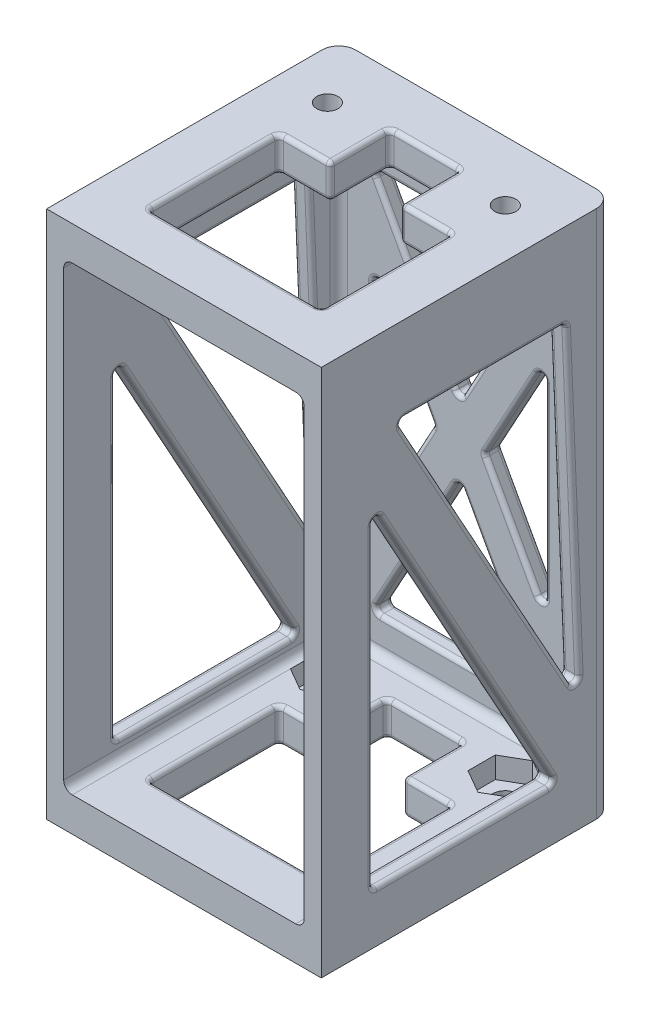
from build123d import *

# Parameters (mm, degrees)
SKETCH1_W           = 32.2
SKETCH1_H           = 34.25
BOSS_EXTRUDE1_DEPTH = 4
SKETCH5_W           = 32.2
SKETCH5_H           = 34.25
BOSS_EXTRUDE2_DEPTH = 4
SKETCH11_W          = 34.25
SKETCH11_H          = 54
BOSS_EXTRUDE3_DEPTH = 2
CUT_EXTRUDE1_REACH  = 79.807
LPATTERN1_COUNT     = 2
LPATTERN1_PITCH     = 30.2
CUT_EXTRUDE3_REACH  = 79.807
CUT_EXTRUDE4_REACH  = 79.807
BOSS_EXTRUDE5_REACH = 79.001
SKETCH18_W          = 2
SKETCH18_H          = 54
CUT_EXTRUDE5_REACH  = 79.807
FILLET9_R           = 0.5
FILLET10_R          = 1
FILLET11_R          = 2
SKETCH20_R          = 1.5
CUT_EXTRUDE6_DEPTH  = 10
CUT_EXTRUDE7_REACH  = 79.807
SKETCH21_R          = 1.25
CUT_EXTRUDE8_DEPTH  = 2.5


with BuildPart() as part:
    # Sketch1 → Boss-Extrude1 (new body)
    with BuildSketch(Plane(origin=(0, 0, 0), x_dir=(1, 0, 0), z_dir=(0, 1, 0))):
        with Locations((16.1, 17.125)):
            Rectangle(SKETCH1_W, SKETCH1_H)
    extrude(amount=BOSS_EXTRUDE1_DEPTH)



with BuildPart() as body_2:
    # Sketch5 → Boss-Extrude2 (new body)
    with BuildSketch(Plane(origin=(0, 58, 0), x_dir=(1, 0, 0), z_dir=(0, 1, 0))):
        with Locations((16.1, 17.125)):
            Rectangle(SKETCH5_W, SKETCH5_H)
    extrude(amount=BOSS_EXTRUDE2_DEPTH)


with BuildPart() as part_1:
    add(part.part)

    add(body_2.part)  # Boss-Extrude3 merges body 2
    # Sketch11 → Boss-Extrude3 (add)
    with BuildSketch(Plane.ZY):
        with Locations((-17.125, 31)):
            Rectangle(SKETCH11_W, SKETCH11_H)
    boss_extrude3 = extrude(amount=-BOSS_EXTRUDE3_DEPTH)

    # Sketch13 → Cut-Extrude1 (cut, up to next)
    with BuildSketch(Plane.ZY, mode=Mode.PRIVATE) as cut_extrude1_sk1:
        Polygon((-28.692392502, 52), (-8.951510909, 52), (-30.282121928, 13.386923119), align=None)
    cut_extrude1_tool1 = extrude(cut_extrude1_sk1.sketch, amount=-CUT_EXTRUDE1_REACH, mode=Mode.PRIVATE) & part_1.part
    # Sketch13 → Cut-Extrude1 (cut, up to next)
    with BuildSketch(Plane.ZY, mode=Mode.PRIVATE) as cut_extrude1_sk2:
        Polygon((-6, 44.934491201), (-6, 6), (-27.50816651, 6), align=None)
    cut_extrude1_tool2 = extrude(cut_extrude1_sk2.sketch, amount=-CUT_EXTRUDE1_REACH, mode=Mode.PRIVATE) & part_1.part
    cut_extrude1_1 = cut_extrude1_tool1.solids().sort_by_distance((0, 39.128974, -22.642008))[0]
    add(cut_extrude1_1, mode=Mode.SUBTRACT)
    cut_extrude1_2 = cut_extrude1_tool2.solids().sort_by_distance((0, 18.978164, -13.169389))[0]
    add(cut_extrude1_2, mode=Mode.SUBTRACT)
    cut_extrude1 = cut_extrude1_1 + cut_extrude1_2  # Cut-Extrude1 as one shape, for the pattern or mirror that repeats it

    # LPattern1: Boss-Extrude3, Cut-Extrude1 ×2
    with Locations(*[(i * LPATTERN1_PITCH, 0, 0) for i in range(1, LPATTERN1_COUNT)]):
        add(boss_extrude3)
        add(cut_extrude1, mode=Mode.SUBTRACT)

    # Sketch16 → Cut-Extrude3 (cut, up to next)
    with BuildSketch(Plane(origin=(0, 62, 0), x_dir=(1, 0, 0), z_dir=(0, 1, 0)), mode=Mode.PRIVATE) as cut_extrude3_sk1:
        Polygon((12, 21.25), (6, 21.25), (6, 6), (26.2, 6), (26.2, 21.25), (20.2, 21.25), (20.2, 28.25), (12, 28.25), align=None)
    cut_extrude3_tool1 = extrude(cut_extrude3_sk1.sketch, amount=-CUT_EXTRUDE3_REACH, mode=Mode.PRIVATE) & part_1.part
    add(cut_extrude3_tool1.solids().sort_by_distance((16.1, 62, -15.372366))[0], mode=Mode.SUBTRACT)

    # Sketch17 → Cut-Extrude4 (cut, up to next)
    with BuildSketch(Plane.XZ, mode=Mode.PRIVATE) as cut_extrude4_sk1:
        Polygon((11.67, -21.25), (6, -21.25), (6, -6), (26.2, -6), (26.2, -21.25), (20.53, -21.25), (20.53, -28.25), (11.67, -28.25), align=None)
    cut_extrude4_tool1 = extrude(cut_extrude4_sk1.sketch, amount=-CUT_EXTRUDE4_REACH, mode=Mode.PRIVATE) & part_1.part
    add(cut_extrude4_tool1.solids().sort_by_distance((16.1, 0, -15.489438))[0], mode=Mode.SUBTRACT)

    # Sketch18 → Boss-Extrude5 (add, up to next)
    with BuildSketch(Plane(origin=(2, 0, 0), x_dir=(0, 0, -1), z_dir=(1, 0, 0)), mode=Mode.PRIVATE) as boss_extrude5_sk1:
        with Locations((33.25, 31)):
            Rectangle(SKETCH18_W, SKETCH18_H)
    boss_extrude5_tool1 = extrude(boss_extrude5_sk1.sketch, amount=BOSS_EXTRUDE5_REACH, mode=Mode.PRIVATE) - part_1.part
    add(boss_extrude5_tool1.solids().sort_by_distance((2, 31, -33.25))[0])

    # Sketch19 → Cut-Extrude5 (cut, up to next)
    with BuildSketch(Plane(origin=(0, 0, -34.25), x_dir=(-1, 0, 0), z_dir=(0, 0, -1)), mode=Mode.PRIVATE) as cut_extrude5_sk1:
        Polygon((-26.2, 52.86920085), (-6, 52.86920085), (-16.1, 34.434600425), align=None)
    cut_extrude5_tool1 = extrude(cut_extrude5_sk1.sketch, amount=-CUT_EXTRUDE5_REACH, mode=Mode.PRIVATE) & part_1.part
    # Sketch19 → Cut-Extrude5 (cut, up to next)
    with BuildSketch(Plane(origin=(0, 0, -34.25), x_dir=(-1, 0, 0), z_dir=(0, 0, -1)), mode=Mode.PRIVATE) as cut_extrude5_sk2:
        Polygon((-16.1, 26.434600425), (-26.2, 8), (-6, 8), align=None)
    cut_extrude5_tool2 = extrude(cut_extrude5_sk2.sketch, amount=-CUT_EXTRUDE5_REACH, mode=Mode.PRIVATE) & part_1.part
    # Sketch19 → Cut-Extrude5 (cut, up to next)
    with BuildSketch(Plane(origin=(0, 0, -34.25), x_dir=(-1, 0, 0), z_dir=(0, 0, -1)), mode=Mode.PRIVATE) as cut_extrude5_sk3:
        Polygon((-6, 43.398410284), (-6, 17.470790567), (-13.102648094, 30.434600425), align=None)
    cut_extrude5_tool3 = extrude(cut_extrude5_sk3.sketch, amount=-CUT_EXTRUDE5_REACH, mode=Mode.PRIVATE) & part_1.part
    # Sketch19 → Cut-Extrude5 (cut, up to next)
    with BuildSketch(Plane(origin=(0, 0, -34.25), x_dir=(-1, 0, 0), z_dir=(0, 0, -1)), mode=Mode.PRIVATE) as cut_extrude5_sk4:
        Polygon((-26.2, 43.398410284), (-19.097351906, 30.434600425), (-26.2, 17.470790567), align=None)
    cut_extrude5_tool4 = extrude(cut_extrude5_sk4.sketch, amount=-CUT_EXTRUDE5_REACH, mode=Mode.PRIVATE) & part_1.part
    add(cut_extrude5_tool1.solids().sort_by_distance((16.1, 46.724334, -34.25))[0], mode=Mode.SUBTRACT)
    add(cut_extrude5_tool2.solids().sort_by_distance((16.1, 14.144867, -34.25))[0], mode=Mode.SUBTRACT)
    add(cut_extrude5_tool3.solids().sort_by_distance((8.367549, 30.4346, -34.25))[0], mode=Mode.SUBTRACT)
    add(cut_extrude5_tool4.solids().sort_by_distance((23.832451, 30.4346, -34.25))[0], mode=Mode.SUBTRACT)

    # Fillet9
    fillet9_edges = [part_1.edges().sort_by_distance(p)[0] for p in [
        (26.2, 60, -21.25),
        (26.2, 60, -6),
        (6, 60, -6),
        (6, 60, -21.25),
        (12, 60, -21.25),
        (12, 60, -28.25),
        (20.2, 60, -28.25),
        (20.2, 60, -21.25),
        (26.2, 62, -13.625),
        (23.2, 62, -21.25),
        (20.2, 62, -24.75),
        (16.1, 62, -28.25),
        (12, 62, -24.75),
        (9, 62, -21.25),
        (6, 62, -13.625),
        (16.1, 62, -6),
        (23.2, 58, -21.25),
        (26.2, 58, -13.625),
        (16.1, 58, -6),
        (6, 58, -13.625),
        (9, 58, -21.25),
        (12, 58, -24.75),
        (16.1, 58, -28.25),
        (20.2, 58, -24.75),
        (16.1, 4, -6),
        (26.2, 4, -13.625),
        (23.365, 4, -21.25),
        (20.53, 4, -24.75),
        (16.1, 4, -28.25),
        (11.67, 4, -24.75),
        (8.835, 4, -21.25),
        (6, 4, -13.625),
        (26.2, 0, -13.625),
        (16.1, 0, -6),
        (6, 0, -13.625),
        (8.835, 0, -21.25),
        (11.67, 0, -24.75),
        (16.1, 0, -28.25),
        (20.53, 0, -24.75),
        (23.365, 0, -21.25),
        (6, 2, -6),
        (6, 2, -21.25),
        (11.67, 2, -21.25),
        (11.67, 2, -28.25),
        (20.53, 2, -28.25),
        (20.53, 2, -21.25),
        (26.2, 2, -21.25),
        (26.2, 2, -6),
        (13.102648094, 30.434600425, -33.25),
        (6, 43.398410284, -33.25),
        (6, 17.470790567, -33.25),
        (9.551324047, 36.916505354, -34.25),
        (9.551324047, 23.952695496, -34.25),
        (6, 30.434600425, -34.25),
        (9.551324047, 23.952695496, -32.25),
        (9.551324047, 36.916505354, -32.25),
        (6, 30.434600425, -32.25),
        (16.1, 26.434600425, -33.25),
        (6, 8, -33.25),
        (26.2, 8, -33.25),
        (11.05, 17.217300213, -34.25),
        (21.15, 17.217300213, -34.25),
        (16.1, 8, -34.25),
        (21.15, 17.217300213, -32.25),
        (11.05, 17.217300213, -32.25),
        (16.1, 8, -32.25),
        (26.2, 17.470790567, -33.25),
        (26.2, 43.398410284, -33.25),
        (19.097351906, 30.434600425, -33.25),
        (26.2, 30.434600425, -34.25),
        (22.648675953, 23.952695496, -34.25),
        (22.648675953, 36.916505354, -34.25),
        (22.648675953, 23.952695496, -32.25),
        (26.2, 30.434600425, -32.25),
        (22.648675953, 36.916505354, -32.25),
        (16.1, 34.434600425, -33.25),
        (26.2, 52.86920085, -33.25),
        (6, 52.86920085, -33.25),
        (21.15, 43.651900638, -34.25),
        (11.05, 43.651900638, -34.25),
        (16.1, 52.86920085, -34.25),
        (11.05, 43.651900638, -32.25),
        (21.15, 43.651900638, -32.25),
        (16.1, 52.86920085, -32.25),
        (2, 6, -16.754083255),
        (1, 6, -6),
        (2, 25.4672456, -16.754083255),
        (1, 6, -27.50816651),
        (2, 25.4672456, -6),
        (1, 44.934491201, -6),
        (0, 6, -16.754083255),
        (0, 25.4672456, -6),
        (0, 25.4672456, -16.754083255),
        (2, 32.693461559, -29.487257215),
        (1, 13.386923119, -30.282121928),
        (2, 52, -18.821951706),
        (1, 52, -28.692392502),
        (2, 32.693461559, -19.616816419),
        (1, 52, -8.951510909),
        (0, 32.693461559, -29.487257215),
        (0, 32.693461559, -19.616816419),
        (0, 52, -18.821951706),
        (31.2, 6, -6),
        (31.2, 6, -27.50816651),
        (31.2, 44.934491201, -6),
        (30.2, 6, -16.754083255),
        (30.2, 25.4672456, -6),
        (30.2, 25.4672456, -16.754083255),
        (32.2, 25.4672456, -6),
        (32.2, 6, -16.754083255),
        (32.2, 25.4672456, -16.754083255),
        (31.2, 13.386923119, -30.282121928),
        (31.2, 52, -28.692392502),
        (31.2, 52, -8.951510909),
        (30.2, 32.693461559, -29.487257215),
        (30.2, 32.693461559, -19.616816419),
        (30.2, 52, -18.821951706),
        (32.2, 32.693461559, -19.616816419),
        (32.2, 32.693461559, -29.487257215),
        (32.2, 52, -18.821951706),
    ]]
    fillet(fillet9_edges, radius=FILLET9_R)

    # Fillet10
    fillet10_edges = [part_1.edges().sort_by_distance(p)[0] for p in [
        (30.2, 4, -16.125),
        (2, 4, -16.125),
        (30.2, 31, -32.25),
        (16.1, 4, -32.25),
        (16.1, 58, -32.25),
        (2, 31, -32.25),
        (2, 58, -16.125),
        (30.2, 58, -16.125),
    ]]
    fillet(fillet10_edges, radius=FILLET10_R)

    # Fillet11
    fillet11_edges = [part_1.edges().sort_by_distance(p)[0] for p in [
        (0, 31, -34.25),
        (32.2, 31, -34.25),
    ]]
    fillet(fillet11_edges, radius=FILLET11_R)

    # Sketch20 → Cut-Extrude6 (cut)
    with BuildSketch(Plane(origin=(0, 4, 0), x_dir=(1, 0, 0), z_dir=(0, 1, 0))):
        with Locations(Location((5.67, 27.25, 0), (0, 0, 270))):
            Circle(SKETCH20_R)
        with Locations(Location((26.53, 27.25, 0), (0, 0, 270))):
            Circle(SKETCH20_R)
    extrude(amount=-CUT_EXTRUDE6_DEPTH, mode=Mode.SUBTRACT)

    # Sketch21 → Cut-Extrude7 (cut, up to next)
    with BuildSketch(Plane(origin=(0, 62, 0), x_dir=(1, 0, 0), z_dir=(0, 1, 0)), mode=Mode.PRIVATE) as cut_extrude7_sk1:
        with Locations(Location((5.67, 27.25, 0), (0, 0, 270))):
            Circle(SKETCH21_R)
    cut_extrude7_tool1 = extrude(cut_extrude7_sk1.sketch, amount=-CUT_EXTRUDE7_REACH, mode=Mode.PRIVATE) & part_1.part
    # Sketch21 → Cut-Extrude7 (cut, up to next)
    with BuildSketch(Plane(origin=(0, 62, 0), x_dir=(1, 0, 0), z_dir=(0, 1, 0)), mode=Mode.PRIVATE) as cut_extrude7_sk2:
        with Locations(Location((26.53, 27.25, 0), (0, 0, 270))):
            Circle(SKETCH21_R)
    cut_extrude7_tool2 = extrude(cut_extrude7_sk2.sketch, amount=-CUT_EXTRUDE7_REACH, mode=Mode.PRIVATE) & part_1.part
    add(cut_extrude7_tool1.solids().sort_by_distance((5.67, 62, -27.25))[0], mode=Mode.SUBTRACT)
    add(cut_extrude7_tool2.solids().sort_by_distance((26.53, 62, -27.25))[0], mode=Mode.SUBTRACT)

    # Sketch22 → Cut-Extrude8 (cut)
    with BuildSketch(Plane(origin=(0, 4, 0), x_dir=(1, 0, 0), z_dir=(0, 1, 0))):
        Polygon((8.445, 25.647853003), (8.445, 28.852146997), (5.67, 30.454293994), (2.895, 28.852146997), (2.895, 25.647853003), (5.67, 24.045706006), align=None)
        Polygon((23.755, 25.647853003), (26.53, 24.045706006), (29.305, 25.647853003), (29.305, 28.852146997), (26.53, 30.454293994), (23.755, 28.852146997), align=None)
    extrude(amount=-CUT_EXTRUDE8_DEPTH, mode=Mode.SUBTRACT)


solid = part_1.part
